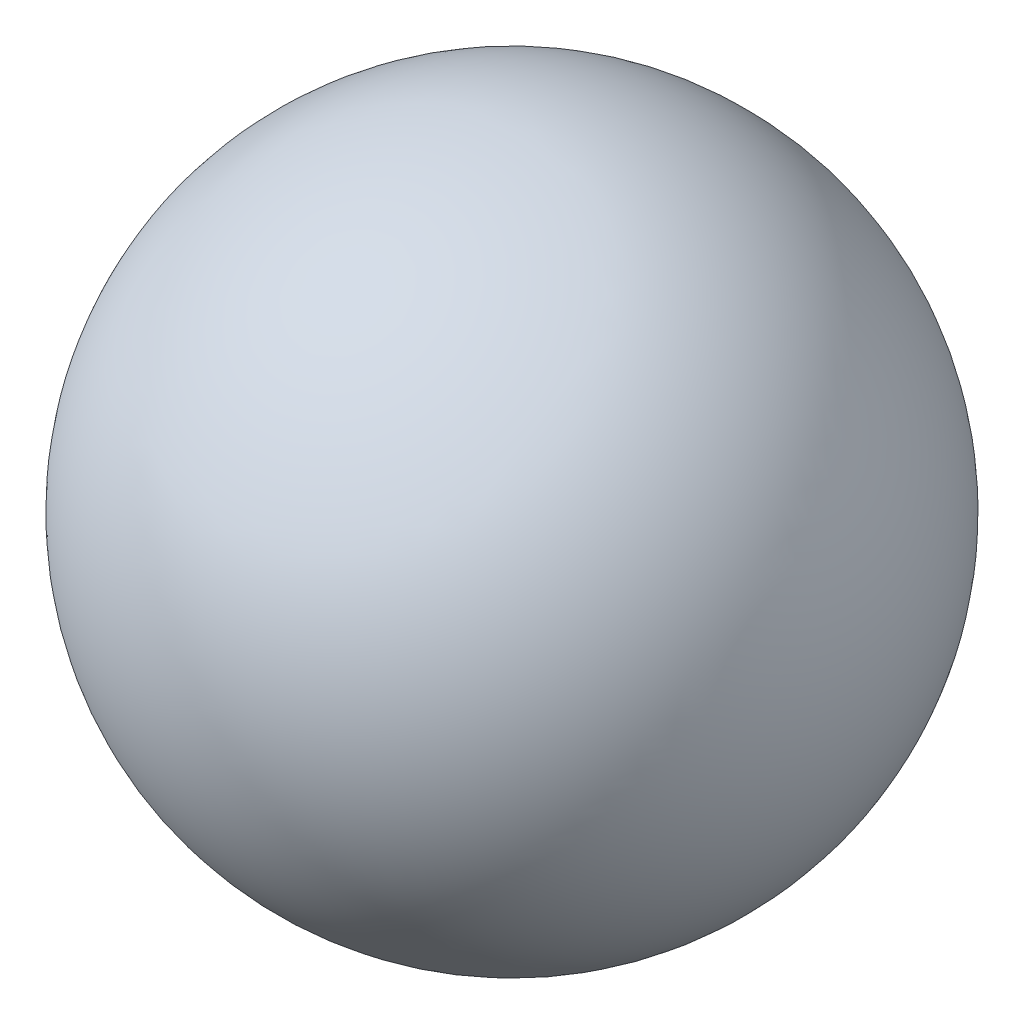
ISO-10303-21;
HEADER;
FILE_DESCRIPTION(('STEP AP214'),'2;1');
FILE_NAME('part.step','',(''),(''),'','','');
FILE_SCHEMA(('AUTOMOTIVE_DESIGN { 1 0 10303 214 1 1 1 1 }'));
ENDSEC;
DATA;
#1=APPLICATION_CONTEXT('core data for automotive mechanical design processes');
#2=APPLICATION_PROTOCOL_DEFINITION('international standard','automotive_design',2000,#1);
#3=PRODUCT_CONTEXT('',#1,'mechanical');
#4=PRODUCT('Part','Part','',(#3));
#5=PRODUCT_RELATED_PRODUCT_CATEGORY('part','',(#4));
#6=PRODUCT_DEFINITION_FORMATION('','',#4);
#7=PRODUCT_DEFINITION_CONTEXT('part definition',#1,'design');
#8=PRODUCT_DEFINITION('design','',#6,#7);
#9=PRODUCT_DEFINITION_SHAPE('','',#8);
#10=(LENGTH_UNIT() NAMED_UNIT(*) SI_UNIT(.MILLI.,.METRE.));
#11=(NAMED_UNIT(*) PLANE_ANGLE_UNIT() SI_UNIT($,.RADIAN.));
#12=(NAMED_UNIT(*) SI_UNIT($,.STERADIAN.) SOLID_ANGLE_UNIT());
#13=UNCERTAINTY_MEASURE_WITH_UNIT(LENGTH_MEASURE(1.E-05),#10,'distance_accuracy_value','');
#14=(GEOMETRIC_REPRESENTATION_CONTEXT(3) GLOBAL_UNCERTAINTY_ASSIGNED_CONTEXT((#13)) GLOBAL_UNIT_ASSIGNED_CONTEXT((#10,
#11,#12)) REPRESENTATION_CONTEXT('',''));
#15=CARTESIAN_POINT('',(0.,0.,0.));
#16=DIRECTION('',(0.,0.,1.));
#17=DIRECTION('',(1.,0.,0.));
#18=AXIS2_PLACEMENT_3D('',#15,#16,#17);
#19=CARTESIAN_POINT('',(0.,0.,0.));
#20=DIRECTION('',(-1.,0.,0.));
#21=DIRECTION('',(0.,1.,0.));
#22=AXIS2_PLACEMENT_3D('',#19,#20,#21);
#23=SPHERICAL_SURFACE('',#22,3.97);
#24=CARTESIAN_POINT('',(-3.97,0.,0.));
#25=VERTEX_POINT('',#24);
#26=VERTEX_LOOP('',#25);
#27=FACE_BOUND('',#26,.T.);
#28=ADVANCED_FACE('F27',(#27),#23,.T.);
#29=CLOSED_SHELL('',(#28));
#30=MANIFOLD_SOLID_BREP('B2',#29);
#31=ADVANCED_BREP_SHAPE_REPRESENTATION('',(#18,#30),#14);
#32=SHAPE_DEFINITION_REPRESENTATION(#9,#31);
ENDSEC;
END-ISO-10303-21;
